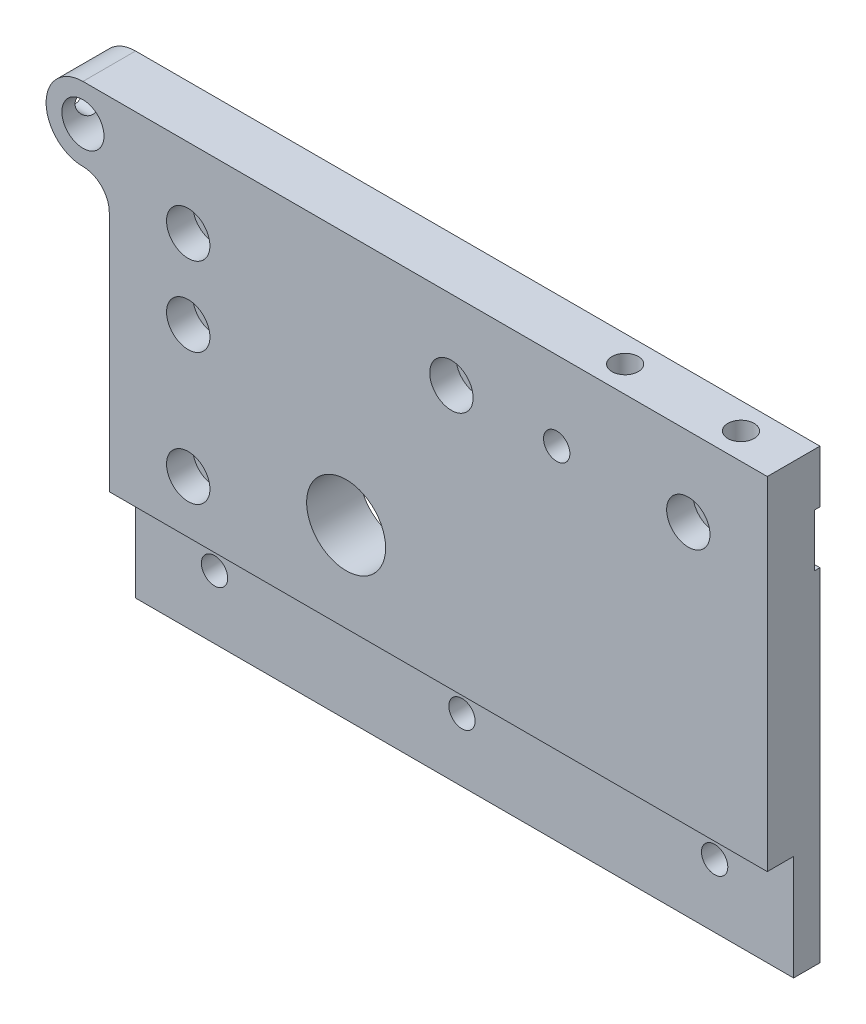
from build123d import *

# Parameters (mm, degrees)
SKETCH1_R                                         = 5.08
SKETCH1_R_2                                       = 9.525
SKETCH1_R_3                                       = 3.175
BOSS_EXTRUDE1_DEPTH                               = 6.35
SKETCH2_W                                         = 158.75
SKETCH2_H                                         = 25.4
CUT_EXTRUDE1_DEPTH                                = 12.7
CBORE_FOR_1_4_PAN_HEAD_MACHINE_SCREW1_D           = 6.7564
CBORE_FOR_1_4_PAN_HEAD_MACHINE_SCREW1_CBORE_D     = 10.4648
CBORE_FOR_1_4_PAN_HEAD_MACHINE_SCREW1_CBORE_DEPTH = 6.35
SKETCH6_R                                         = 3.175
CUT_EXTRUDE2_DEPTH                                = 22.098
SKETCH7_W                                         = 157.48
SKETCH7_H                                         = 12.7
CUT_EXTRUDE3_DEPTH                                = 1.27
SKETCH8_R                                         = 3.175
CUT_EXTRUDE4_DEPTH                                = 12.7
SKETCH9_R                                         = 3.175
CUT_EXTRUDE5_DEPTH                                = 8.89


with BuildPart() as part:
    # Sketch1 → Boss-Extrude1 (new, symmetric)
    with BuildSketch(Plane.XY):
        with BuildLine():
            Line((-85.725, 53.975), (79.375, 53.975))
            Line((79.375, 53.975), (79.375, -53.975))
            Line((79.375, -53.975), (-79.375, -53.975))
            Line((-79.375, -53.975), (-79.375, 29.845))
            ThreePointArc((-79.375, 29.845), (-81.234871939, 34.335128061), (-85.725, 36.195))
            ThreePointArc((-85.725, 36.195), (-94.615, 45.085), (-85.725, 53.975))
        make_face()
        with Locations((-85.725, 45.085)):
            Circle(SKETCH1_R, mode=Mode.SUBTRACT)
        with Locations((-22.225, -6.985)):
            Circle(SKETCH1_R_2, mode=Mode.SUBTRACT)
        with Locations((-60.325, -38.735)):
            Circle(SKETCH1_R_3, mode=Mode.SUBTRACT)
        with Locations((-0.635, -38.735)):
            Circle(SKETCH1_R_3, mode=Mode.SUBTRACT)
        with Locations((60.325, -38.735)):
            Circle(SKETCH1_R_3, mode=Mode.SUBTRACT)
    extrude(amount=BOSS_EXTRUDE1_DEPTH, both=True)

    # Sketch2 → Cut-Extrude1 (cut)
    with BuildSketch(Plane.XY):
        with Locations((0, -41.275)):
            Rectangle(SKETCH2_W, SKETCH2_H)
    extrude(amount=CUT_EXTRUDE1_DEPTH, mode=Mode.SUBTRACT)

    # CBORE for 1_4 Pan Head Machine Screw1 (through all)
    with Locations(Plane.XY.offset(6.35)):
        with Locations((-60.325, -15.875), (-60.325, 15.875), (-60.325, 34.925), (3.175, 34.925), (60.325, 34.925)):
            CounterBoreHole(CBORE_FOR_1_4_PAN_HEAD_MACHINE_SCREW1_D / 2, CBORE_FOR_1_4_PAN_HEAD_MACHINE_SCREW1_CBORE_D / 2, CBORE_FOR_1_4_PAN_HEAD_MACHINE_SCREW1_CBORE_DEPTH)

    # Sketch6 → Cut-Extrude2 (cut)
    with BuildSketch(Plane.XY.offset(6.35)):
        with Locations((28.575, 34.925)):
            Circle(SKETCH6_R)
    extrude(amount=-CUT_EXTRUDE2_DEPTH, mode=Mode.SUBTRACT)

    # Sketch7 → Cut-Extrude3 (cut)
    with BuildSketch(Plane(origin=(0, 0, -6.35), x_dir=(-1, 0, 0), z_dir=(0, 0, -1))):
        with Locations((-0.635, 34.925)):
            Rectangle(SKETCH7_W, SKETCH7_H)
    extrude(amount=-CUT_EXTRUDE3_DEPTH, mode=Mode.SUBTRACT)

    # Sketch8 → Cut-Extrude4 (cut)
    with BuildSketch(Plane(origin=(0, 53.975, 0), x_dir=(1, 0, 0), z_dir=(0, 1, 0))):
        with Locations(Location((66.675, 0, 0), (0, 0, 180))):
            Circle(SKETCH8_R)
        with Locations(Location((38.735, 0, 0), (0, 0, 180))):
            Circle(SKETCH8_R)
    extrude(amount=-CUT_EXTRUDE4_DEPTH, mode=Mode.SUBTRACT)

    # Sketch9 → Cut-Extrude5 (cut)
    with BuildSketch(Plane.ZY.offset(94.615)):
        with Locations((0, 45.085)):
            Circle(SKETCH9_R)
    extrude(amount=-CUT_EXTRUDE5_DEPTH, mode=Mode.SUBTRACT)


solid = part.part
